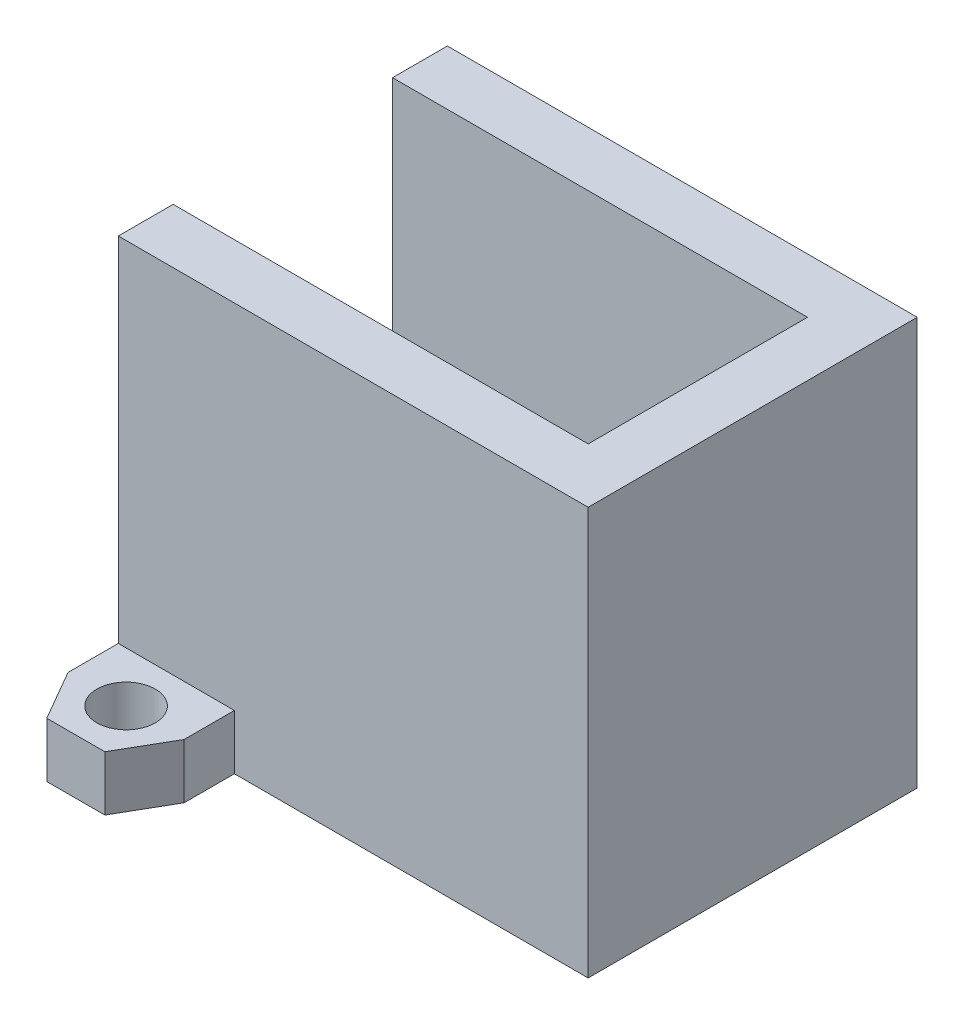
ISO-10303-21;
HEADER;
FILE_DESCRIPTION(('STEP AP214'),'2;1');
FILE_NAME('part.step','',(''),(''),'','','');
FILE_SCHEMA(('AUTOMOTIVE_DESIGN { 1 0 10303 214 1 1 1 1 }'));
ENDSEC;
DATA;
#1=APPLICATION_CONTEXT('core data for automotive mechanical design processes');
#2=APPLICATION_PROTOCOL_DEFINITION('international standard','automotive_design',2000,#1);
#3=PRODUCT_CONTEXT('',#1,'mechanical');
#4=PRODUCT('Part','Part','',(#3));
#5=PRODUCT_RELATED_PRODUCT_CATEGORY('part','',(#4));
#6=PRODUCT_DEFINITION_FORMATION('','',#4);
#7=PRODUCT_DEFINITION_CONTEXT('part definition',#1,'design');
#8=PRODUCT_DEFINITION('design','',#6,#7);
#9=PRODUCT_DEFINITION_SHAPE('','',#8);
#10=(LENGTH_UNIT() NAMED_UNIT(*) SI_UNIT(.MILLI.,.METRE.));
#11=(NAMED_UNIT(*) PLANE_ANGLE_UNIT() SI_UNIT($,.RADIAN.));
#12=(NAMED_UNIT(*) SI_UNIT($,.STERADIAN.) SOLID_ANGLE_UNIT());
#13=UNCERTAINTY_MEASURE_WITH_UNIT(LENGTH_MEASURE(1.E-05),#10,'distance_accuracy_value','');
#14=(GEOMETRIC_REPRESENTATION_CONTEXT(3) GLOBAL_UNCERTAINTY_ASSIGNED_CONTEXT((#13)) GLOBAL_UNIT_ASSIGNED_CONTEXT((#10,
#11,#12)) REPRESENTATION_CONTEXT('',''));
#15=CARTESIAN_POINT('',(0.,0.,0.));
#16=DIRECTION('',(0.,0.,1.));
#17=DIRECTION('',(1.,0.,0.));
#18=AXIS2_PLACEMENT_3D('',#15,#16,#17);
#19=CARTESIAN_POINT('',(-11.35,3.,0.));
#20=DIRECTION('',(-1.,0.,0.));
#21=DIRECTION('',(0.,0.,1.));
#22=AXIS2_PLACEMENT_3D('',#19,#20,#21);
#23=PLANE('',#22);
#24=DIRECTION('',(0.,0.,-1.));
#25=VECTOR('',#24,1.);
#26=CARTESIAN_POINT('',(-11.35,0.,0.));
#27=LINE('',#26,#25);
#28=CARTESIAN_POINT('',(-11.35,0.,11.75));
#29=VERTEX_POINT('',#28);
#30=CARTESIAN_POINT('',(-11.35,0.,6.));
#31=VERTEX_POINT('',#30);
#32=EDGE_CURVE('E316',#29,#31,#27,.T.);
#33=ORIENTED_EDGE('',*,*,#32,.F.);
#34=DIRECTION('',(0.,-1.,0.));
#35=VECTOR('',#34,1.);
#36=CARTESIAN_POINT('',(-11.35,3.,11.75));
#37=LINE('',#36,#35);
#38=CARTESIAN_POINT('',(-11.35,3.,11.75));
#39=VERTEX_POINT('',#38);
#40=EDGE_CURVE('E11',#39,#29,#37,.T.);
#41=ORIENTED_EDGE('',*,*,#40,.F.);
#42=DIRECTION('',(0.,0.,-1.));
#43=VECTOR('',#42,1.);
#44=CARTESIAN_POINT('',(-11.35,3.,0.));
#45=LINE('',#44,#43);
#46=CARTESIAN_POINT('',(-11.35,3.,9.));
#47=VERTEX_POINT('',#46);
#48=EDGE_CURVE('E317',#39,#47,#45,.T.);
#49=ORIENTED_EDGE('',*,*,#48,.T.);
#50=DIRECTION('',(0.,-1.,0.));
#51=VECTOR('',#50,1.);
#52=CARTESIAN_POINT('',(-11.35,22.3,9.));
#53=LINE('',#52,#51);
#54=CARTESIAN_POINT('',(-11.35,22.3,9.));
#55=VERTEX_POINT('',#54);
#56=EDGE_CURVE('E308',#55,#47,#53,.T.);
#57=ORIENTED_EDGE('',*,*,#56,.F.);
#58=DIRECTION('',(0.,0.,1.));
#59=VECTOR('',#58,1.);
#60=CARTESIAN_POINT('',(-11.35,22.3,0.));
#61=LINE('',#60,#59);
#62=CARTESIAN_POINT('',(-11.35,22.3,6.));
#63=VERTEX_POINT('',#62);
#64=EDGE_CURVE('E242',#63,#55,#61,.T.);
#65=ORIENTED_EDGE('',*,*,#64,.F.);
#66=DIRECTION('',(0.,-1.,0.));
#67=VECTOR('',#66,1.);
#68=CARTESIAN_POINT('',(-11.35,22.3,6.));
#69=LINE('',#68,#67);
#70=EDGE_CURVE('E312',#63,#31,#69,.T.);
#71=ORIENTED_EDGE('',*,*,#70,.T.);
#72=EDGE_LOOP('',(#33,#41,#49,#57,#65,#71));
#73=FACE_BOUND('',#72,.T.);
#74=ADVANCED_FACE('F47',(#73),#23,.T.);
#75=CARTESIAN_POINT('',(-13.6003992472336,3.,7.85219416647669));
#76=DIRECTION('',(-0.866025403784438,0.,0.5));
#77=DIRECTION('',(0.5,0.,0.866025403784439));
#78=AXIS2_PLACEMENT_3D('',#75,#76,#77);
#79=PLANE('',#78);
#80=DIRECTION('',(-0.5,0.,-0.866025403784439));
#81=VECTOR('',#80,1.);
#82=CARTESIAN_POINT('',(-13.6003992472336,0.,7.85219416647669));
#83=LINE('',#82,#81);
#84=CARTESIAN_POINT('',(-9.76228675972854,0.,14.5));
#85=VERTEX_POINT('',#84);
#86=EDGE_CURVE('E347',#85,#29,#83,.T.);
#87=ORIENTED_EDGE('',*,*,#86,.F.);
#88=DIRECTION('',(0.,-1.,0.));
#89=VECTOR('',#88,1.);
#90=CARTESIAN_POINT('',(-9.76228675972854,3.,14.5));
#91=LINE('',#90,#89);
#92=CARTESIAN_POINT('',(-9.76228675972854,3.,14.5));
#93=VERTEX_POINT('',#92);
#94=EDGE_CURVE('E55',#93,#85,#91,.T.);
#95=ORIENTED_EDGE('',*,*,#94,.F.);
#96=DIRECTION('',(-0.5,0.,-0.866025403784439));
#97=VECTOR('',#96,1.);
#98=CARTESIAN_POINT('',(-13.6003992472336,3.,7.85219416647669));
#99=LINE('',#98,#97);
#100=EDGE_CURVE('E320',#93,#39,#99,.T.);
#101=ORIENTED_EDGE('',*,*,#100,.T.);
#102=ORIENTED_EDGE('',*,*,#40,.T.);
#103=EDGE_LOOP('',(#87,#95,#101,#102));
#104=FACE_BOUND('',#103,.T.);
#105=ADVANCED_FACE('F381',(#104),#79,.T.);
#106=CARTESIAN_POINT('',(0.,3.,14.5));
#107=DIRECTION('',(0.,0.,1.));
#108=DIRECTION('',(1.,0.,0.));
#109=AXIS2_PLACEMENT_3D('',#106,#107,#108);
#110=PLANE('',#109);
#111=DIRECTION('',(-1.,0.,0.));
#112=VECTOR('',#111,1.);
#113=CARTESIAN_POINT('',(0.,0.,14.5));
#114=LINE('',#113,#112);
#115=CARTESIAN_POINT('',(-6.58686027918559,0.,14.5));
#116=VERTEX_POINT('',#115);
#117=EDGE_CURVE('E351',#116,#85,#114,.T.);
#118=ORIENTED_EDGE('',*,*,#117,.F.);
#119=DIRECTION('',(0.,-1.,0.));
#120=VECTOR('',#119,1.);
#121=CARTESIAN_POINT('',(-6.58686027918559,3.,14.5));
#122=LINE('',#121,#120);
#123=CARTESIAN_POINT('',(-6.58686027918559,3.,14.5));
#124=VERTEX_POINT('',#123);
#125=EDGE_CURVE('E371',#124,#116,#122,.T.);
#126=ORIENTED_EDGE('',*,*,#125,.F.);
#127=DIRECTION('',(-1.,0.,0.));
#128=VECTOR('',#127,1.);
#129=CARTESIAN_POINT('',(0.,3.,14.5));
#130=LINE('',#129,#128);
#131=EDGE_CURVE('E325',#124,#93,#130,.T.);
#132=ORIENTED_EDGE('',*,*,#131,.T.);
#133=ORIENTED_EDGE('',*,*,#94,.T.);
#134=EDGE_LOOP('',(#118,#126,#132,#133));
#135=FACE_BOUND('',#134,.T.);
#136=ADVANCED_FACE('F377',(#135),#110,.T.);
#137=CARTESIAN_POINT('',(1.33853896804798,3.,0.772805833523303));
#138=DIRECTION('',(0.866025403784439,0.,0.5));
#139=DIRECTION('',(0.5,0.,-0.866025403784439));
#140=AXIS2_PLACEMENT_3D('',#137,#138,#139);
#141=PLANE('',#140);
#142=DIRECTION('',(-0.5,0.,0.866025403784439));
#143=VECTOR('',#142,1.);
#144=CARTESIAN_POINT('',(1.33853896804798,0.,0.772805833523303));
#145=LINE('',#144,#143);
#146=CARTESIAN_POINT('',(-4.99914703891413,0.,11.75));
#147=VERTEX_POINT('',#146);
#148=EDGE_CURVE('E355',#147,#116,#145,.T.);
#149=ORIENTED_EDGE('',*,*,#148,.F.);
#150=DIRECTION('',(0.,-1.,0.));
#151=VECTOR('',#150,1.);
#152=CARTESIAN_POINT('',(-4.99914703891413,3.,11.75));
#153=LINE('',#152,#151);
#154=CARTESIAN_POINT('',(-4.99914703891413,3.,11.75));
#155=VERTEX_POINT('',#154);
#156=EDGE_CURVE('E368',#155,#147,#153,.T.);
#157=ORIENTED_EDGE('',*,*,#156,.F.);
#158=DIRECTION('',(-0.5,0.,0.866025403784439));
#159=VECTOR('',#158,1.);
#160=CARTESIAN_POINT('',(1.33853896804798,3.,0.772805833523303));
#161=LINE('',#160,#159);
#162=EDGE_CURVE('E329',#155,#124,#161,.T.);
#163=ORIENTED_EDGE('',*,*,#162,.T.);
#164=ORIENTED_EDGE('',*,*,#125,.T.);
#165=EDGE_LOOP('',(#149,#157,#163,#164));
#166=FACE_BOUND('',#165,.T.);
#167=ADVANCED_FACE('F390',(#166),#141,.T.);
#168=CARTESIAN_POINT('',(-4.99914703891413,3.,0.));
#169=DIRECTION('',(-1.,0.,0.));
#170=DIRECTION('',(0.,0.,1.));
#171=AXIS2_PLACEMENT_3D('',#168,#169,#170);
#172=PLANE('',#171);
#173=DIRECTION('',(0.,0.,-1.));
#174=VECTOR('',#173,1.);
#175=CARTESIAN_POINT('',(-4.99914703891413,0.,0.));
#176=LINE('',#175,#174);
#177=CARTESIAN_POINT('',(-4.99914703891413,0.,9.));
#178=VERTEX_POINT('',#177);
#179=EDGE_CURVE('E359',#147,#178,#176,.T.);
#180=ORIENTED_EDGE('',*,*,#179,.T.);
#181=DIRECTION('',(0.,-1.,0.));
#182=VECTOR('',#181,1.);
#183=CARTESIAN_POINT('',(-4.99914703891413,3.,9.));
#184=LINE('',#183,#182);
#185=CARTESIAN_POINT('',(-4.99914703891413,3.,9.));
#186=VERTEX_POINT('',#185);
#187=EDGE_CURVE('E344',#186,#178,#184,.T.);
#188=ORIENTED_EDGE('',*,*,#187,.F.);
#189=DIRECTION('',(0.,0.,-1.));
#190=VECTOR('',#189,1.);
#191=CARTESIAN_POINT('',(-4.99914703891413,3.,0.));
#192=LINE('',#191,#190);
#193=EDGE_CURVE('E333',#155,#186,#192,.T.);
#194=ORIENTED_EDGE('',*,*,#193,.F.);
#195=ORIENTED_EDGE('',*,*,#156,.T.);
#196=EDGE_LOOP('',(#180,#188,#194,#195));
#197=FACE_BOUND('',#196,.T.);
#198=ADVANCED_FACE('F464',(#197),#172,.F.);
#199=CARTESIAN_POINT('',(-8.17457351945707,3.,11.75));
#200=DIRECTION('',(0.,-1.,0.));
#201=DIRECTION('',(0.,0.,-1.));
#202=AXIS2_PLACEMENT_3D('',#199,#200,#201);
#203=CYLINDRICAL_SURFACE('',#202,1.6);
#204=CARTESIAN_POINT('',(-8.17457351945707,3.,11.75));
#205=DIRECTION('',(0.,1.,0.));
#206=DIRECTION('',(0.,0.,1.));
#207=AXIS2_PLACEMENT_3D('',#204,#205,#206);
#208=CIRCLE('',#207,1.6);
#209=CARTESIAN_POINT('',(-8.17457351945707,3.,13.35));
#210=VERTEX_POINT('',#209);
#211=EDGE_CURVE('E340',#210,#210,#208,.F.);
#212=ORIENTED_EDGE('',*,*,#211,.F.);
#213=EDGE_LOOP('',(#212));
#214=FACE_BOUND('',#213,.T.);
#215=CARTESIAN_POINT('',(-8.17457351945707,0.,11.75));
#216=DIRECTION('',(0.,1.,0.));
#217=DIRECTION('',(0.,0.,1.));
#218=AXIS2_PLACEMENT_3D('',#215,#216,#217);
#219=CIRCLE('',#218,1.6);
#220=CARTESIAN_POINT('',(-8.17457351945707,0.,13.35));
#221=VERTEX_POINT('',#220);
#222=EDGE_CURVE('E321',#221,#221,#219,.F.);
#223=ORIENTED_EDGE('',*,*,#222,.T.);
#224=EDGE_LOOP('',(#223));
#225=FACE_BOUND('',#224,.T.);
#226=ADVANCED_FACE('F466',(#214,#225),#203,.F.);
#227=CARTESIAN_POINT('',(0.,3.,0.));
#228=DIRECTION('',(0.,1.,0.));
#229=DIRECTION('',(0.,0.,1.));
#230=AXIS2_PLACEMENT_3D('',#227,#228,#229);
#231=PLANE('',#230);
#232=ORIENTED_EDGE('',*,*,#48,.F.);
#233=ORIENTED_EDGE('',*,*,#100,.F.);
#234=ORIENTED_EDGE('',*,*,#131,.F.);
#235=ORIENTED_EDGE('',*,*,#162,.F.);
#236=ORIENTED_EDGE('',*,*,#193,.T.);
#237=DIRECTION('',(1.,0.,0.));
#238=VECTOR('',#237,1.);
#239=CARTESIAN_POINT('',(0.,3.,9.));
#240=LINE('',#239,#238);
#241=EDGE_CURVE('E336',#47,#186,#240,.T.);
#242=ORIENTED_EDGE('',*,*,#241,.F.);
#243=EDGE_LOOP('',(#232,#233,#234,#235,#236,#242));
#244=FACE_BOUND('',#243,.T.);
#245=ORIENTED_EDGE('',*,*,#211,.T.);
#246=EDGE_LOOP('',(#245));
#247=FACE_BOUND('',#246,.T.);
#248=ADVANCED_FACE('F395',(#244,#247),#231,.T.);
#249=CARTESIAN_POINT('',(0.,0.,0.));
#250=DIRECTION('',(0.,1.,0.));
#251=DIRECTION('',(0.,0.,1.));
#252=AXIS2_PLACEMENT_3D('',#249,#250,#251);
#253=PLANE('',#252);
#254=ORIENTED_EDGE('',*,*,#32,.T.);
#255=DIRECTION('',(1.,0.,0.));
#256=VECTOR('',#255,1.);
#257=CARTESIAN_POINT('',(0.,0.,6.));
#258=LINE('',#257,#256);
#259=CARTESIAN_POINT('',(11.35,0.,6.));
#260=VERTEX_POINT('',#259);
#261=EDGE_CURVE('E174',#31,#260,#258,.T.);
#262=ORIENTED_EDGE('',*,*,#261,.T.);
#263=DIRECTION('',(0.,0.,1.));
#264=VECTOR('',#263,1.);
#265=CARTESIAN_POINT('',(11.35,0.,0.));
#266=LINE('',#265,#264);
#267=CARTESIAN_POINT('',(11.35,0.,-6.));
#268=VERTEX_POINT('',#267);
#269=EDGE_CURVE('E243',#268,#260,#266,.T.);
#270=ORIENTED_EDGE('',*,*,#269,.F.);
#271=DIRECTION('',(1.,0.,0.));
#272=VECTOR('',#271,1.);
#273=CARTESIAN_POINT('',(0.,0.,-6.));
#274=LINE('',#273,#272);
#275=CARTESIAN_POINT('',(-11.35,0.,-6.));
#276=VERTEX_POINT('',#275);
#277=EDGE_CURVE('E282',#276,#268,#274,.T.);
#278=ORIENTED_EDGE('',*,*,#277,.F.);
#279=DIRECTION('',(0.,0.,1.));
#280=VECTOR('',#279,1.);
#281=CARTESIAN_POINT('',(-11.35,0.,0.));
#282=LINE('',#281,#280);
#283=CARTESIAN_POINT('',(-11.35,0.,-11.75));
#284=VERTEX_POINT('',#283);
#285=EDGE_CURVE('E279',#284,#276,#282,.T.);
#286=ORIENTED_EDGE('',*,*,#285,.F.);
#287=DIRECTION('',(-0.5,0.,0.866025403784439));
#288=VECTOR('',#287,1.);
#289=CARTESIAN_POINT('',(-13.6003992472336,0.,-7.85219416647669));
#290=LINE('',#289,#288);
#291=CARTESIAN_POINT('',(-9.76228675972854,0.,-14.5));
#292=VERTEX_POINT('',#291);
#293=EDGE_CURVE('E218',#292,#284,#290,.T.);
#294=ORIENTED_EDGE('',*,*,#293,.F.);
#295=DIRECTION('',(-1.,0.,0.));
#296=VECTOR('',#295,1.);
#297=CARTESIAN_POINT('',(0.,0.,-14.5));
#298=LINE('',#297,#296);
#299=CARTESIAN_POINT('',(-6.58686027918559,0.,-14.5));
#300=VERTEX_POINT('',#299);
#301=EDGE_CURVE('E215',#300,#292,#298,.T.);
#302=ORIENTED_EDGE('',*,*,#301,.F.);
#303=DIRECTION('',(-0.5,0.,-0.866025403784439));
#304=VECTOR('',#303,1.);
#305=CARTESIAN_POINT('',(1.33853896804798,0.,-0.772805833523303));
#306=LINE('',#305,#304);
#307=CARTESIAN_POINT('',(-4.99914703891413,0.,-11.75));
#308=VERTEX_POINT('',#307);
#309=EDGE_CURVE('E212',#308,#300,#306,.T.);
#310=ORIENTED_EDGE('',*,*,#309,.F.);
#311=DIRECTION('',(0.,0.,1.));
#312=VECTOR('',#311,1.);
#313=CARTESIAN_POINT('',(-4.99914703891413,0.,0.));
#314=LINE('',#313,#312);
#315=CARTESIAN_POINT('',(-4.99914703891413,0.,-9.));
#316=VERTEX_POINT('',#315);
#317=EDGE_CURVE('E209',#308,#316,#314,.T.);
#318=ORIENTED_EDGE('',*,*,#317,.T.);
#319=DIRECTION('',(1.,0.,0.));
#320=VECTOR('',#319,1.);
#321=CARTESIAN_POINT('',(0.,0.,-9.));
#322=LINE('',#321,#320);
#323=CARTESIAN_POINT('',(14.35,0.,-9.));
#324=VERTEX_POINT('',#323);
#325=EDGE_CURVE('E68',#316,#324,#322,.T.);
#326=ORIENTED_EDGE('',*,*,#325,.T.);
#327=DIRECTION('',(0.,0.,1.));
#328=VECTOR('',#327,1.);
#329=CARTESIAN_POINT('',(14.35,0.,0.));
#330=LINE('',#329,#328);
#331=CARTESIAN_POINT('',(14.35,0.,9.));
#332=VERTEX_POINT('',#331);
#333=EDGE_CURVE('E273',#324,#332,#330,.T.);
#334=ORIENTED_EDGE('',*,*,#333,.T.);
#335=DIRECTION('',(1.,0.,0.));
#336=VECTOR('',#335,1.);
#337=CARTESIAN_POINT('',(0.,0.,9.));
#338=LINE('',#337,#336);
#339=EDGE_CURVE('E270',#178,#332,#338,.T.);
#340=ORIENTED_EDGE('',*,*,#339,.F.);
#341=ORIENTED_EDGE('',*,*,#179,.F.);
#342=ORIENTED_EDGE('',*,*,#148,.T.);
#343=ORIENTED_EDGE('',*,*,#117,.T.);
#344=ORIENTED_EDGE('',*,*,#86,.T.);
#345=EDGE_LOOP('',(#254,#262,#270,#278,#286,#294,#302,#310,#318,#326,#334,#340,#341,#342,#343,#344));
#346=FACE_BOUND('',#345,.T.);
#347=ORIENTED_EDGE('',*,*,#222,.F.);
#348=EDGE_LOOP('',(#347));
#349=FACE_BOUND('',#348,.T.);
#350=CARTESIAN_POINT('',(-8.17457351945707,0.,-11.75));
#351=DIRECTION('',(0.,1.,0.));
#352=DIRECTION('',(0.,0.,1.));
#353=AXIS2_PLACEMENT_3D('',#350,#351,#352);
#354=CIRCLE('',#353,1.6);
#355=CARTESIAN_POINT('',(-8.17457351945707,0.,-10.15));
#356=VERTEX_POINT('',#355);
#357=EDGE_CURVE('E186',#356,#356,#354,.T.);
#358=ORIENTED_EDGE('',*,*,#357,.T.);
#359=EDGE_LOOP('',(#358));
#360=FACE_BOUND('',#359,.T.);
#361=ADVANCED_FACE('F384',(#346,#349,#360),#253,.F.);
#362=CARTESIAN_POINT('',(0.,22.3,9.));
#363=DIRECTION('',(0.,0.,-1.));
#364=DIRECTION('',(-1.,0.,0.));
#365=AXIS2_PLACEMENT_3D('',#362,#363,#364);
#366=PLANE('',#365);
#367=ORIENTED_EDGE('',*,*,#56,.T.);
#368=ORIENTED_EDGE('',*,*,#241,.T.);
#369=ORIENTED_EDGE('',*,*,#187,.T.);
#370=ORIENTED_EDGE('',*,*,#339,.T.);
#371=DIRECTION('',(0.,-1.,0.));
#372=VECTOR('',#371,1.);
#373=CARTESIAN_POINT('',(14.35,22.3,9.));
#374=LINE('',#373,#372);
#375=CARTESIAN_POINT('',(14.35,22.3,9.));
#376=VERTEX_POINT('',#375);
#377=EDGE_CURVE('E304',#376,#332,#374,.T.);
#378=ORIENTED_EDGE('',*,*,#377,.F.);
#379=DIRECTION('',(1.,0.,0.));
#380=VECTOR('',#379,1.);
#381=CARTESIAN_POINT('',(0.,22.3,9.));
#382=LINE('',#381,#380);
#383=EDGE_CURVE('E246',#55,#376,#382,.T.);
#384=ORIENTED_EDGE('',*,*,#383,.F.);
#385=EDGE_LOOP('',(#367,#368,#369,#370,#378,#384));
#386=FACE_BOUND('',#385,.T.);
#387=ADVANCED_FACE('F472',(#386),#366,.F.);
#388=CARTESIAN_POINT('',(0.,22.3,6.));
#389=DIRECTION('',(0.,0.,-1.));
#390=DIRECTION('',(-1.,0.,0.));
#391=AXIS2_PLACEMENT_3D('',#388,#389,#390);
#392=PLANE('',#391);
#393=ORIENTED_EDGE('',*,*,#261,.F.);
#394=ORIENTED_EDGE('',*,*,#70,.F.);
#395=DIRECTION('',(1.,0.,0.));
#396=VECTOR('',#395,1.);
#397=CARTESIAN_POINT('',(0.,22.3,6.));
#398=LINE('',#397,#396);
#399=CARTESIAN_POINT('',(11.35,22.3,6.));
#400=VERTEX_POINT('',#399);
#401=EDGE_CURVE('E238',#63,#400,#398,.T.);
#402=ORIENTED_EDGE('',*,*,#401,.T.);
#403=DIRECTION('',(0.,-1.,0.));
#404=VECTOR('',#403,1.);
#405=CARTESIAN_POINT('',(11.35,22.3,6.));
#406=LINE('',#405,#404);
#407=EDGE_CURVE('E266',#400,#260,#406,.T.);
#408=ORIENTED_EDGE('',*,*,#407,.T.);
#409=EDGE_LOOP('',(#393,#394,#402,#408));
#410=FACE_BOUND('',#409,.T.);
#411=ADVANCED_FACE('F406',(#410),#392,.T.);
#412=CARTESIAN_POINT('',(14.35,22.3,0.));
#413=DIRECTION('',(1.,0.,0.));
#414=DIRECTION('',(0.,0.,-1.));
#415=AXIS2_PLACEMENT_3D('',#412,#413,#414);
#416=PLANE('',#415);
#417=ORIENTED_EDGE('',*,*,#333,.F.);
#418=DIRECTION('',(0.,-1.,0.));
#419=VECTOR('',#418,1.);
#420=CARTESIAN_POINT('',(14.35,22.3,-9.));
#421=LINE('',#420,#419);
#422=CARTESIAN_POINT('',(14.35,22.3,-9.));
#423=VERTEX_POINT('',#422);
#424=EDGE_CURVE('E301',#423,#324,#421,.T.);
#425=ORIENTED_EDGE('',*,*,#424,.F.);
#426=DIRECTION('',(0.,0.,1.));
#427=VECTOR('',#426,1.);
#428=CARTESIAN_POINT('',(14.35,22.3,0.));
#429=LINE('',#428,#427);
#430=EDGE_CURVE('E249',#423,#376,#429,.T.);
#431=ORIENTED_EDGE('',*,*,#430,.T.);
#432=ORIENTED_EDGE('',*,*,#377,.T.);
#433=EDGE_LOOP('',(#417,#425,#431,#432));
#434=FACE_BOUND('',#433,.T.);
#435=ADVANCED_FACE('F434',(#434),#416,.T.);
#436=CARTESIAN_POINT('',(0.,22.3,-9.));
#437=DIRECTION('',(0.,0.,-1.));
#438=DIRECTION('',(-1.,0.,0.));
#439=AXIS2_PLACEMENT_3D('',#436,#437,#438);
#440=PLANE('',#439);
#441=DIRECTION('',(0.,-1.,0.));
#442=VECTOR('',#441,1.);
#443=CARTESIAN_POINT('',(-4.99914703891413,3.,-9.));
#444=LINE('',#443,#442);
#445=CARTESIAN_POINT('',(-4.99914703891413,3.,-9.));
#446=VERTEX_POINT('',#445);
#447=EDGE_CURVE('E167',#446,#316,#444,.T.);
#448=ORIENTED_EDGE('',*,*,#447,.F.);
#449=DIRECTION('',(1.,0.,0.));
#450=VECTOR('',#449,1.);
#451=CARTESIAN_POINT('',(0.,3.,-9.));
#452=LINE('',#451,#450);
#453=CARTESIAN_POINT('',(-11.35,3.,-9.));
#454=VERTEX_POINT('',#453);
#455=EDGE_CURVE('E62',#454,#446,#452,.T.);
#456=ORIENTED_EDGE('',*,*,#455,.F.);
#457=DIRECTION('',(0.,-1.,0.));
#458=VECTOR('',#457,1.);
#459=CARTESIAN_POINT('',(-11.35,22.3,-9.));
#460=LINE('',#459,#458);
#461=CARTESIAN_POINT('',(-11.35,22.3,-9.));
#462=VERTEX_POINT('',#461);
#463=EDGE_CURVE('E298',#462,#454,#460,.T.);
#464=ORIENTED_EDGE('',*,*,#463,.F.);
#465=DIRECTION('',(1.,0.,0.));
#466=VECTOR('',#465,1.);
#467=CARTESIAN_POINT('',(0.,22.3,-9.));
#468=LINE('',#467,#466);
#469=EDGE_CURVE('E253',#462,#423,#468,.T.);
#470=ORIENTED_EDGE('',*,*,#469,.T.);
#471=ORIENTED_EDGE('',*,*,#424,.T.);
#472=ORIENTED_EDGE('',*,*,#325,.F.);
#473=EDGE_LOOP('',(#448,#456,#464,#470,#471,#472));
#474=FACE_BOUND('',#473,.T.);
#475=ADVANCED_FACE('F168',(#474),#440,.T.);
#476=CARTESIAN_POINT('',(-11.35,22.3,0.));
#477=DIRECTION('',(1.,0.,0.));
#478=DIRECTION('',(0.,0.,-1.));
#479=AXIS2_PLACEMENT_3D('',#476,#477,#478);
#480=PLANE('',#479);
#481=ORIENTED_EDGE('',*,*,#285,.T.);
#482=DIRECTION('',(0.,-1.,0.));
#483=VECTOR('',#482,1.);
#484=CARTESIAN_POINT('',(-11.35,22.3,-6.));
#485=LINE('',#484,#483);
#486=CARTESIAN_POINT('',(-11.35,22.3,-6.));
#487=VERTEX_POINT('',#486);
#488=EDGE_CURVE('E294',#487,#276,#485,.T.);
#489=ORIENTED_EDGE('',*,*,#488,.F.);
#490=DIRECTION('',(0.,0.,1.));
#491=VECTOR('',#490,1.);
#492=CARTESIAN_POINT('',(-11.35,22.3,0.));
#493=LINE('',#492,#491);
#494=EDGE_CURVE('E257',#462,#487,#493,.T.);
#495=ORIENTED_EDGE('',*,*,#494,.F.);
#496=ORIENTED_EDGE('',*,*,#463,.T.);
#497=DIRECTION('',(0.,0.,1.));
#498=VECTOR('',#497,1.);
#499=CARTESIAN_POINT('',(-11.35,3.,0.));
#500=LINE('',#499,#498);
#501=CARTESIAN_POINT('',(-11.35,3.,-11.75));
#502=VERTEX_POINT('',#501);
#503=EDGE_CURVE('E184',#502,#454,#500,.T.);
#504=ORIENTED_EDGE('',*,*,#503,.F.);
#505=DIRECTION('',(0.,-1.,0.));
#506=VECTOR('',#505,1.);
#507=CARTESIAN_POINT('',(-11.35,3.,-11.75));
#508=LINE('',#507,#506);
#509=EDGE_CURVE('E208',#502,#284,#508,.T.);
#510=ORIENTED_EDGE('',*,*,#509,.T.);
#511=EDGE_LOOP('',(#481,#489,#495,#496,#504,#510));
#512=FACE_BOUND('',#511,.T.);
#513=ADVANCED_FACE('F425',(#512),#480,.F.);
#514=CARTESIAN_POINT('',(0.,22.3,-6.));
#515=DIRECTION('',(0.,0.,-1.));
#516=DIRECTION('',(-1.,0.,0.));
#517=AXIS2_PLACEMENT_3D('',#514,#515,#516);
#518=PLANE('',#517);
#519=ORIENTED_EDGE('',*,*,#277,.T.);
#520=DIRECTION('',(0.,-1.,0.));
#521=VECTOR('',#520,1.);
#522=CARTESIAN_POINT('',(11.35,22.3,-6.));
#523=LINE('',#522,#521);
#524=CARTESIAN_POINT('',(11.35,22.3,-6.));
#525=VERTEX_POINT('',#524);
#526=EDGE_CURVE('E290',#525,#268,#523,.T.);
#527=ORIENTED_EDGE('',*,*,#526,.F.);
#528=DIRECTION('',(1.,0.,0.));
#529=VECTOR('',#528,1.);
#530=CARTESIAN_POINT('',(0.,22.3,-6.));
#531=LINE('',#530,#529);
#532=EDGE_CURVE('E260',#487,#525,#531,.T.);
#533=ORIENTED_EDGE('',*,*,#532,.F.);
#534=ORIENTED_EDGE('',*,*,#488,.T.);
#535=EDGE_LOOP('',(#519,#527,#533,#534));
#536=FACE_BOUND('',#535,.T.);
#537=ADVANCED_FACE('F415',(#536),#518,.F.);
#538=CARTESIAN_POINT('',(11.35,22.3,0.));
#539=DIRECTION('',(1.,0.,0.));
#540=DIRECTION('',(0.,0.,-1.));
#541=AXIS2_PLACEMENT_3D('',#538,#539,#540);
#542=PLANE('',#541);
#543=ORIENTED_EDGE('',*,*,#269,.T.);
#544=ORIENTED_EDGE('',*,*,#407,.F.);
#545=DIRECTION('',(0.,0.,1.));
#546=VECTOR('',#545,1.);
#547=CARTESIAN_POINT('',(11.35,22.3,0.));
#548=LINE('',#547,#546);
#549=EDGE_CURVE('E263',#525,#400,#548,.T.);
#550=ORIENTED_EDGE('',*,*,#549,.F.);
#551=ORIENTED_EDGE('',*,*,#526,.T.);
#552=EDGE_LOOP('',(#543,#544,#550,#551));
#553=FACE_BOUND('',#552,.T.);
#554=ADVANCED_FACE('F411',(#553),#542,.F.);
#555=CARTESIAN_POINT('',(0.,22.3,0.));
#556=DIRECTION('',(0.,1.,0.));
#557=DIRECTION('',(0.,0.,1.));
#558=AXIS2_PLACEMENT_3D('',#555,#556,#557);
#559=PLANE('',#558);
#560=ORIENTED_EDGE('',*,*,#401,.F.);
#561=ORIENTED_EDGE('',*,*,#64,.T.);
#562=ORIENTED_EDGE('',*,*,#383,.T.);
#563=ORIENTED_EDGE('',*,*,#430,.F.);
#564=ORIENTED_EDGE('',*,*,#469,.F.);
#565=ORIENTED_EDGE('',*,*,#494,.T.);
#566=ORIENTED_EDGE('',*,*,#532,.T.);
#567=ORIENTED_EDGE('',*,*,#549,.T.);
#568=EDGE_LOOP('',(#560,#561,#562,#563,#564,#565,#566,#567));
#569=FACE_BOUND('',#568,.T.);
#570=ADVANCED_FACE('F431',(#569),#559,.T.);
#571=CARTESIAN_POINT('',(-4.99914703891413,3.,0.));
#572=DIRECTION('',(1.,0.,0.));
#573=DIRECTION('',(0.,0.,-1.));
#574=AXIS2_PLACEMENT_3D('',#571,#572,#573);
#575=PLANE('',#574);
#576=ORIENTED_EDGE('',*,*,#317,.F.);
#577=DIRECTION('',(0.,-1.,0.));
#578=VECTOR('',#577,1.);
#579=CARTESIAN_POINT('',(-4.99914703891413,3.,-11.75));
#580=LINE('',#579,#578);
#581=CARTESIAN_POINT('',(-4.99914703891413,3.,-11.75));
#582=VERTEX_POINT('',#581);
#583=EDGE_CURVE('E175',#582,#308,#580,.T.);
#584=ORIENTED_EDGE('',*,*,#583,.F.);
#585=DIRECTION('',(0.,0.,1.));
#586=VECTOR('',#585,1.);
#587=CARTESIAN_POINT('',(-4.99914703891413,3.,0.));
#588=LINE('',#587,#586);
#589=EDGE_CURVE('E182',#582,#446,#588,.T.);
#590=ORIENTED_EDGE('',*,*,#589,.T.);
#591=ORIENTED_EDGE('',*,*,#447,.T.);
#592=EDGE_LOOP('',(#576,#584,#590,#591));
#593=FACE_BOUND('',#592,.T.);
#594=ADVANCED_FACE('F188',(#593),#575,.T.);
#595=CARTESIAN_POINT('',(1.33853896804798,3.,-0.772805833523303));
#596=DIRECTION('',(-0.866025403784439,0.,0.5));
#597=DIRECTION('',(0.5,0.,0.866025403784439));
#598=AXIS2_PLACEMENT_3D('',#595,#596,#597);
#599=PLANE('',#598);
#600=ORIENTED_EDGE('',*,*,#309,.T.);
#601=DIRECTION('',(0.,-1.,0.));
#602=VECTOR('',#601,1.);
#603=CARTESIAN_POINT('',(-6.58686027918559,3.,-14.5));
#604=LINE('',#603,#602);
#605=CARTESIAN_POINT('',(-6.58686027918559,3.,-14.5));
#606=VERTEX_POINT('',#605);
#607=EDGE_CURVE('E232',#606,#300,#604,.T.);
#608=ORIENTED_EDGE('',*,*,#607,.F.);
#609=DIRECTION('',(-0.5,0.,-0.866025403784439));
#610=VECTOR('',#609,1.);
#611=CARTESIAN_POINT('',(1.33853896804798,3.,-0.772805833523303));
#612=LINE('',#611,#610);
#613=EDGE_CURVE('E191',#582,#606,#612,.T.);
#614=ORIENTED_EDGE('',*,*,#613,.F.);
#615=ORIENTED_EDGE('',*,*,#583,.T.);
#616=EDGE_LOOP('',(#600,#608,#614,#615));
#617=FACE_BOUND('',#616,.T.);
#618=ADVANCED_FACE('F438',(#617),#599,.F.);
#619=CARTESIAN_POINT('',(0.,3.,-14.5));
#620=DIRECTION('',(0.,0.,1.));
#621=DIRECTION('',(1.,0.,0.));
#622=AXIS2_PLACEMENT_3D('',#619,#620,#621);
#623=PLANE('',#622);
#624=ORIENTED_EDGE('',*,*,#301,.T.);
#625=DIRECTION('',(0.,-1.,0.));
#626=VECTOR('',#625,1.);
#627=CARTESIAN_POINT('',(-9.76228675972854,3.,-14.5));
#628=LINE('',#627,#626);
#629=CARTESIAN_POINT('',(-9.76228675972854,3.,-14.5));
#630=VERTEX_POINT('',#629);
#631=EDGE_CURVE('E228',#630,#292,#628,.T.);
#632=ORIENTED_EDGE('',*,*,#631,.F.);
#633=DIRECTION('',(-1.,0.,0.));
#634=VECTOR('',#633,1.);
#635=CARTESIAN_POINT('',(0.,3.,-14.5));
#636=LINE('',#635,#634);
#637=EDGE_CURVE('E194',#606,#630,#636,.T.);
#638=ORIENTED_EDGE('',*,*,#637,.F.);
#639=ORIENTED_EDGE('',*,*,#607,.T.);
#640=EDGE_LOOP('',(#624,#632,#638,#639));
#641=FACE_BOUND('',#640,.T.);
#642=ADVANCED_FACE('F441',(#641),#623,.F.);
#643=CARTESIAN_POINT('',(-13.6003992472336,3.,-7.85219416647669));
#644=DIRECTION('',(0.866025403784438,0.,0.5));
#645=DIRECTION('',(0.5,0.,-0.866025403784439));
#646=AXIS2_PLACEMENT_3D('',#643,#644,#645);
#647=PLANE('',#646);
#648=ORIENTED_EDGE('',*,*,#293,.T.);
#649=ORIENTED_EDGE('',*,*,#509,.F.);
#650=DIRECTION('',(-0.5,0.,0.866025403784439));
#651=VECTOR('',#650,1.);
#652=CARTESIAN_POINT('',(-13.6003992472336,3.,-7.85219416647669));
#653=LINE('',#652,#651);
#654=EDGE_CURVE('E199',#630,#502,#653,.T.);
#655=ORIENTED_EDGE('',*,*,#654,.F.);
#656=ORIENTED_EDGE('',*,*,#631,.T.);
#657=EDGE_LOOP('',(#648,#649,#655,#656));
#658=FACE_BOUND('',#657,.T.);
#659=ADVANCED_FACE('F422',(#658),#647,.F.);
#660=CARTESIAN_POINT('',(-8.17457351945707,3.,-11.75));
#661=DIRECTION('',(0.,-1.,0.));
#662=DIRECTION('',(0.,0.,-1.));
#663=AXIS2_PLACEMENT_3D('',#660,#661,#662);
#664=CYLINDRICAL_SURFACE('',#663,1.6);
#665=CARTESIAN_POINT('',(-8.17457351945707,3.,-11.75));
#666=DIRECTION('',(0.,1.,0.));
#667=DIRECTION('',(0.,0.,1.));
#668=AXIS2_PLACEMENT_3D('',#665,#666,#667);
#669=CIRCLE('',#668,1.6);
#670=CARTESIAN_POINT('',(-8.17457351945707,3.,-10.15));
#671=VERTEX_POINT('',#670);
#672=EDGE_CURVE('E204',#671,#671,#669,.T.);
#673=ORIENTED_EDGE('',*,*,#672,.T.);
#674=EDGE_LOOP('',(#673));
#675=FACE_BOUND('',#674,.T.);
#676=ORIENTED_EDGE('',*,*,#357,.F.);
#677=EDGE_LOOP('',(#676));
#678=FACE_BOUND('',#677,.T.);
#679=ADVANCED_FACE('F448',(#675,#678),#664,.F.);
#680=CARTESIAN_POINT('',(0.,3.,0.));
#681=DIRECTION('',(0.,1.,0.));
#682=DIRECTION('',(0.,0.,1.));
#683=AXIS2_PLACEMENT_3D('',#680,#681,#682);
#684=PLANE('',#683);
#685=ORIENTED_EDGE('',*,*,#455,.T.);
#686=ORIENTED_EDGE('',*,*,#589,.F.);
#687=ORIENTED_EDGE('',*,*,#613,.T.);
#688=ORIENTED_EDGE('',*,*,#637,.T.);
#689=ORIENTED_EDGE('',*,*,#654,.T.);
#690=ORIENTED_EDGE('',*,*,#503,.T.);
#691=EDGE_LOOP('',(#685,#686,#687,#688,#689,#690));
#692=FACE_BOUND('',#691,.T.);
#693=ORIENTED_EDGE('',*,*,#672,.F.);
#694=EDGE_LOOP('',(#693));
#695=FACE_BOUND('',#694,.T.);
#696=ADVANCED_FACE('F180',(#692,#695),#684,.T.);
#697=CLOSED_SHELL('',(#74,#105,#136,#167,#198,#226,#248,#361,#387,#411,#435,#475,#513,#537,#554,
#570,#594,#618,#642,#659,#679,#696));
#698=MANIFOLD_SOLID_BREP('B2',#697);
#699=ADVANCED_BREP_SHAPE_REPRESENTATION('',(#18,#698),#14);
#700=SHAPE_DEFINITION_REPRESENTATION(#9,#699);
ENDSEC;
END-ISO-10303-21;
